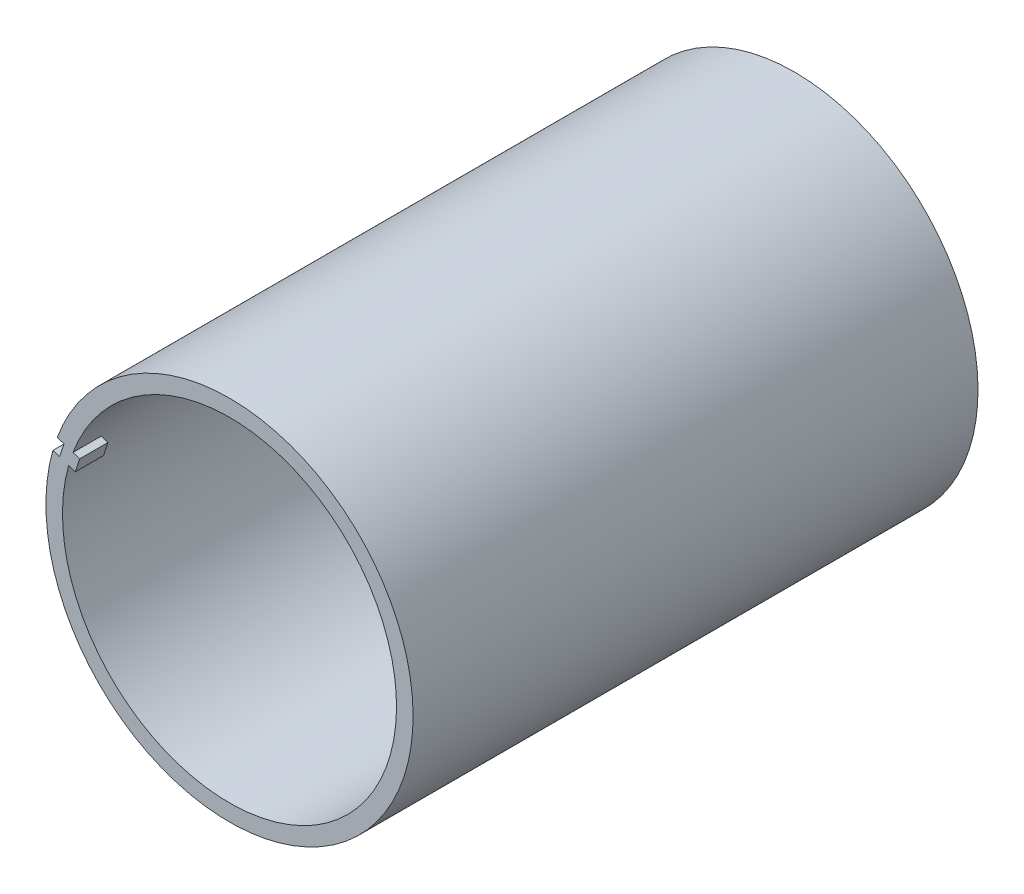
ISO-10303-21;
HEADER;
FILE_DESCRIPTION(('STEP AP214'),'2;1');
FILE_NAME('part.step','',(''),(''),'','','');
FILE_SCHEMA(('AUTOMOTIVE_DESIGN { 1 0 10303 214 1 1 1 1 }'));
ENDSEC;
DATA;
#1=APPLICATION_CONTEXT('core data for automotive mechanical design processes');
#2=APPLICATION_PROTOCOL_DEFINITION('international standard','automotive_design',2000,#1);
#3=PRODUCT_CONTEXT('',#1,'mechanical');
#4=PRODUCT('Part','Part','',(#3));
#5=PRODUCT_RELATED_PRODUCT_CATEGORY('part','',(#4));
#6=PRODUCT_DEFINITION_FORMATION('','',#4);
#7=PRODUCT_DEFINITION_CONTEXT('part definition',#1,'design');
#8=PRODUCT_DEFINITION('design','',#6,#7);
#9=PRODUCT_DEFINITION_SHAPE('','',#8);
#10=(LENGTH_UNIT() NAMED_UNIT(*) SI_UNIT(.MILLI.,.METRE.));
#11=(NAMED_UNIT(*) PLANE_ANGLE_UNIT() SI_UNIT($,.RADIAN.));
#12=(NAMED_UNIT(*) SI_UNIT($,.STERADIAN.) SOLID_ANGLE_UNIT());
#13=UNCERTAINTY_MEASURE_WITH_UNIT(LENGTH_MEASURE(1.E-05),#10,'distance_accuracy_value','');
#14=(GEOMETRIC_REPRESENTATION_CONTEXT(3) GLOBAL_UNCERTAINTY_ASSIGNED_CONTEXT((#13)) GLOBAL_UNIT_ASSIGNED_CONTEXT((#10,
#11,#12)) REPRESENTATION_CONTEXT('',''));
#15=CARTESIAN_POINT('',(0.,0.,0.));
#16=DIRECTION('',(0.,0.,1.));
#17=DIRECTION('',(1.,0.,0.));
#18=AXIS2_PLACEMENT_3D('',#15,#16,#17);
#19=CARTESIAN_POINT('',(0.,24.7771123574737,4.));
#20=DIRECTION('',(0.,0.,1.));
#21=DIRECTION('',(1.,0.,0.));
#22=AXIS2_PLACEMENT_3D('',#19,#20,#21);
#23=PLANE('',#22);
#24=DIRECTION('',(0.951056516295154,-0.309016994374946,0.));
#25=VECTOR('',#24,1.);
#26=CARTESIAN_POINT('',(-21.2122972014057,32.7208677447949,4.));
#27=LINE('',#26,#25);
#28=CARTESIAN_POINT('',(-22.1633537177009,33.0298847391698,4.));
#29=VERTEX_POINT('',#28);
#30=CARTESIAN_POINT('',(-21.2122972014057,32.7208677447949,4.));
#31=VERTEX_POINT('',#30);
#32=EDGE_CURVE('E249',#29,#31,#27,.T.);
#33=ORIENTED_EDGE('',*,*,#32,.F.);
#34=CARTESIAN_POINT('',(0.,24.7771123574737,4.));
#35=DIRECTION('',(0.,0.,1.));
#36=DIRECTION('',(1.,0.,0.));
#37=AXIS2_PLACEMENT_3D('',#34,#35,#36);
#38=CIRCLE('',#37,23.6500000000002);
#39=CARTESIAN_POINT('',(-22.7813877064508,31.1277717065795,4.));
#40=VERTEX_POINT('',#39);
#41=EDGE_CURVE('E218',#29,#40,#38,.T.);
#42=ORIENTED_EDGE('',*,*,#41,.T.);
#43=DIRECTION('',(-0.951056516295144,0.309016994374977,0.));
#44=VECTOR('',#43,1.);
#45=CARTESIAN_POINT('',(-21.8303311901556,30.8187547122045,4.));
#46=LINE('',#45,#44);
#47=CARTESIAN_POINT('',(-21.8303311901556,30.8187547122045,4.));
#48=VERTEX_POINT('',#47);
#49=EDGE_CURVE('E255',#48,#40,#46,.T.);
#50=ORIENTED_EDGE('',*,*,#49,.F.);
#51=DIRECTION('',(-0.309016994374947,-0.951056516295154,0.));
#52=VECTOR('',#51,1.);
#53=CARTESIAN_POINT('',(-21.2122972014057,32.7208677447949,4.));
#54=LINE('',#53,#52);
#55=EDGE_CURVE('E251',#31,#48,#54,.T.);
#56=ORIENTED_EDGE('',*,*,#55,.F.);
#57=EDGE_LOOP('',(#33,#42,#50,#56));
#58=FACE_BOUND('',#57,.T.);
#59=ADVANCED_FACE('F29',(#58),#23,.T.);
#60=CARTESIAN_POINT('',(0.,24.7771123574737,0.));
#61=DIRECTION('',(0.,0.,1.));
#62=DIRECTION('',(1.,0.,0.));
#63=AXIS2_PLACEMENT_3D('',#60,#61,#62);
#64=PLANE('',#63);
#65=CARTESIAN_POINT('',(0.,24.7771123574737,0.));
#66=DIRECTION('',(0.,0.,1.));
#67=DIRECTION('',(1.,0.,0.));
#68=AXIS2_PLACEMENT_3D('',#65,#66,#67);
#69=CIRCLE('',#68,25.9980881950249);
#70=CARTESIAN_POINT('',(-25.0163705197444,31.8539616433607,0.));
#71=VERTEX_POINT('',#70);
#72=CARTESIAN_POINT('',(-24.3983365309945,33.7560746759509,0.));
#73=VERTEX_POINT('',#72);
#74=EDGE_CURVE('E245',#71,#73,#69,.T.);
#75=ORIENTED_EDGE('',*,*,#74,.F.);
#76=DIRECTION('',(-0.951056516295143,0.30901699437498,0.));
#77=VECTOR('',#76,1.);
#78=CARTESIAN_POINT('',(-24.0653140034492,31.5449446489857,0.));
#79=LINE('',#78,#77);
#80=CARTESIAN_POINT('',(-24.0653140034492,31.5449446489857,0.));
#81=VERTEX_POINT('',#80);
#82=EDGE_CURVE('E300',#81,#71,#79,.T.);
#83=ORIENTED_EDGE('',*,*,#82,.F.);
#84=DIRECTION('',(-0.309016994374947,-0.951056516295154,0.));
#85=VECTOR('',#84,1.);
#86=CARTESIAN_POINT('',(-23.4472800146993,33.447057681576,0.));
#87=LINE('',#86,#85);
#88=CARTESIAN_POINT('',(-23.4472800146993,33.447057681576,0.));
#89=VERTEX_POINT('',#88);
#90=EDGE_CURVE('E291',#89,#81,#87,.T.);
#91=ORIENTED_EDGE('',*,*,#90,.F.);
#92=DIRECTION('',(0.951056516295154,-0.309016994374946,0.));
#93=VECTOR('',#92,1.);
#94=CARTESIAN_POINT('',(-23.4472800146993,33.447057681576,0.));
#95=LINE('',#94,#93);
#96=EDGE_CURVE('E299',#73,#89,#95,.T.);
#97=ORIENTED_EDGE('',*,*,#96,.F.);
#98=EDGE_LOOP('',(#75,#83,#91,#97));
#99=FACE_BOUND('',#98,.T.);
#100=CARTESIAN_POINT('',(0.,24.7771123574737,0.));
#101=DIRECTION('',(0.,0.,1.));
#102=DIRECTION('',(1.,0.,0.));
#103=AXIS2_PLACEMENT_3D('',#100,#101,#102);
#104=CIRCLE('',#103,23.6500000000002);
#105=CARTESIAN_POINT('',(-22.7813877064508,31.1277717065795,0.));
#106=VERTEX_POINT('',#105);
#107=CARTESIAN_POINT('',(-22.1633537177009,33.0298847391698,0.));
#108=VERTEX_POINT('',#107);
#109=EDGE_CURVE('E236',#106,#108,#104,.T.);
#110=ORIENTED_EDGE('',*,*,#109,.T.);
#111=DIRECTION('',(0.951056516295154,-0.309016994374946,0.));
#112=VECTOR('',#111,1.);
#113=CARTESIAN_POINT('',(-21.2122972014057,32.7208677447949,0.));
#114=LINE('',#113,#112);
#115=CARTESIAN_POINT('',(-21.2122972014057,32.7208677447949,0.));
#116=VERTEX_POINT('',#115);
#117=EDGE_CURVE('E314',#108,#116,#114,.T.);
#118=ORIENTED_EDGE('',*,*,#117,.T.);
#119=DIRECTION('',(-0.309016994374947,-0.951056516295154,0.));
#120=VECTOR('',#119,1.);
#121=CARTESIAN_POINT('',(-21.2122972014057,32.7208677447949,0.));
#122=LINE('',#121,#120);
#123=CARTESIAN_POINT('',(-21.8303311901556,30.8187547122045,0.));
#124=VERTEX_POINT('',#123);
#125=EDGE_CURVE('E312',#116,#124,#122,.T.);
#126=ORIENTED_EDGE('',*,*,#125,.T.);
#127=DIRECTION('',(-0.951056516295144,0.309016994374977,0.));
#128=VECTOR('',#127,1.);
#129=CARTESIAN_POINT('',(-21.8303311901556,30.8187547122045,0.));
#130=LINE('',#129,#128);
#131=EDGE_CURVE('E252',#124,#106,#130,.T.);
#132=ORIENTED_EDGE('',*,*,#131,.T.);
#133=EDGE_LOOP('',(#110,#118,#126,#132));
#134=FACE_BOUND('',#133,.T.);
#135=ADVANCED_FACE('F297',(#99,#134),#64,.F.);
#136=CARTESIAN_POINT('',(0.,24.7771123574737,4.));
#137=DIRECTION('',(0.,0.,-1.));
#138=DIRECTION('',(-1.,0.,0.));
#139=AXIS2_PLACEMENT_3D('',#136,#137,#138);
#140=CYLINDRICAL_SURFACE('',#139,25.9980881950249);
#141=ORIENTED_EDGE('',*,*,#74,.T.);
#142=DIRECTION('',(0.,0.,-1.));
#143=VECTOR('',#142,1.);
#144=CARTESIAN_POINT('',(-24.3983365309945,33.7560746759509,4.));
#145=LINE('',#144,#143);
#146=CARTESIAN_POINT('',(-24.3983365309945,33.7560746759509,4.));
#147=VERTEX_POINT('',#146);
#148=EDGE_CURVE('E11',#147,#73,#145,.T.);
#149=ORIENTED_EDGE('',*,*,#148,.F.);
#150=CARTESIAN_POINT('',(0.,24.7771123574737,4.));
#151=DIRECTION('',(0.,0.,1.));
#152=DIRECTION('',(1.,0.,0.));
#153=AXIS2_PLACEMENT_3D('',#150,#151,#152);
#154=CIRCLE('',#153,25.9980881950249);
#155=CARTESIAN_POINT('',(-25.0163705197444,31.8539616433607,4.));
#156=VERTEX_POINT('',#155);
#157=EDGE_CURVE('E229',#147,#156,#154,.T.);
#158=ORIENTED_EDGE('',*,*,#157,.T.);
#159=DIRECTION('',(0.,0.,-1.));
#160=VECTOR('',#159,1.);
#161=CARTESIAN_POINT('',(-25.0163705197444,31.8539616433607,4.));
#162=LINE('',#161,#160);
#163=EDGE_CURVE('E266',#156,#71,#162,.T.);
#164=ORIENTED_EDGE('',*,*,#163,.T.);
#165=EDGE_LOOP('',(#141,#149,#158,#164));
#166=FACE_BOUND('',#165,.T.);
#167=CARTESIAN_POINT('',(0.,24.7771123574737,76.));
#168=DIRECTION('',(0.,0.,1.));
#169=DIRECTION('',(1.,0.,0.));
#170=AXIS2_PLACEMENT_3D('',#167,#168,#169);
#171=CIRCLE('',#170,25.9980881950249);
#172=CARTESIAN_POINT('',(-24.3983365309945,33.7560746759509,76.));
#173=VERTEX_POINT('',#172);
#174=CARTESIAN_POINT('',(-25.0163705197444,31.8539616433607,76.));
#175=VERTEX_POINT('',#174);
#176=EDGE_CURVE('E232',#173,#175,#171,.T.);
#177=ORIENTED_EDGE('',*,*,#176,.F.);
#178=DIRECTION('',(0.,0.,-1.));
#179=VECTOR('',#178,1.);
#180=CARTESIAN_POINT('',(-24.3983365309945,33.7560746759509,80.));
#181=LINE('',#180,#179);
#182=CARTESIAN_POINT('',(-24.3983365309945,33.7560746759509,80.));
#183=VERTEX_POINT('',#182);
#184=EDGE_CURVE('E217',#183,#173,#181,.T.);
#185=ORIENTED_EDGE('',*,*,#184,.F.);
#186=CARTESIAN_POINT('',(0.,24.7771123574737,80.));
#187=DIRECTION('',(0.,0.,1.));
#188=DIRECTION('',(1.,0.,0.));
#189=AXIS2_PLACEMENT_3D('',#186,#187,#188);
#190=CIRCLE('',#189,25.9980881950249);
#191=CARTESIAN_POINT('',(-25.0163705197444,31.8539616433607,80.));
#192=VERTEX_POINT('',#191);
#193=EDGE_CURVE('E193',#192,#183,#190,.T.);
#194=ORIENTED_EDGE('',*,*,#193,.F.);
#195=DIRECTION('',(0.,0.,-1.));
#196=VECTOR('',#195,1.);
#197=CARTESIAN_POINT('',(-25.0163705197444,31.8539616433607,80.));
#198=LINE('',#197,#196);
#199=EDGE_CURVE('E200',#192,#175,#198,.T.);
#200=ORIENTED_EDGE('',*,*,#199,.T.);
#201=EDGE_LOOP('',(#177,#185,#194,#200));
#202=FACE_BOUND('',#201,.T.);
#203=ADVANCED_FACE('F31',(#166,#202),#140,.T.);
#204=CARTESIAN_POINT('',(-23.4472800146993,33.447057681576,4.));
#205=DIRECTION('',(0.309016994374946,0.951056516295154,0.));
#206=DIRECTION('',(-0.951056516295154,0.309016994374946,0.));
#207=AXIS2_PLACEMENT_3D('',#204,#205,#206);
#208=PLANE('',#207);
#209=ORIENTED_EDGE('',*,*,#96,.T.);
#210=DIRECTION('',(0.,0.,-1.));
#211=VECTOR('',#210,1.);
#212=CARTESIAN_POINT('',(-23.4472800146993,33.447057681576,4.));
#213=LINE('',#212,#211);
#214=CARTESIAN_POINT('',(-23.4472800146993,33.447057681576,4.));
#215=VERTEX_POINT('',#214);
#216=EDGE_CURVE('E38',#215,#89,#213,.T.);
#217=ORIENTED_EDGE('',*,*,#216,.F.);
#218=DIRECTION('',(0.951056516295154,-0.309016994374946,0.));
#219=VECTOR('',#218,1.);
#220=CARTESIAN_POINT('',(-23.4472800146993,33.447057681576,4.));
#221=LINE('',#220,#219);
#222=EDGE_CURVE('E277',#147,#215,#221,.T.);
#223=ORIENTED_EDGE('',*,*,#222,.F.);
#224=ORIENTED_EDGE('',*,*,#148,.T.);
#225=EDGE_LOOP('',(#209,#217,#223,#224));
#226=FACE_BOUND('',#225,.T.);
#227=ADVANCED_FACE('F349',(#226),#208,.F.);
#228=CARTESIAN_POINT('',(-23.4472800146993,33.447057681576,4.));
#229=DIRECTION('',(0.951056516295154,-0.309016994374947,0.));
#230=DIRECTION('',(0.309016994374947,0.951056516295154,0.));
#231=AXIS2_PLACEMENT_3D('',#228,#229,#230);
#232=PLANE('',#231);
#233=ORIENTED_EDGE('',*,*,#90,.T.);
#234=DIRECTION('',(0.,0.,-1.));
#235=VECTOR('',#234,1.);
#236=CARTESIAN_POINT('',(-24.0653140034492,31.5449446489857,4.));
#237=LINE('',#236,#235);
#238=CARTESIAN_POINT('',(-24.0653140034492,31.5449446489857,4.));
#239=VERTEX_POINT('',#238);
#240=EDGE_CURVE('E269',#239,#81,#237,.T.);
#241=ORIENTED_EDGE('',*,*,#240,.F.);
#242=DIRECTION('',(-0.309016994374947,-0.951056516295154,0.));
#243=VECTOR('',#242,1.);
#244=CARTESIAN_POINT('',(-23.4472800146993,33.447057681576,4.));
#245=LINE('',#244,#243);
#246=EDGE_CURVE('E276',#215,#239,#245,.T.);
#247=ORIENTED_EDGE('',*,*,#246,.F.);
#248=ORIENTED_EDGE('',*,*,#216,.T.);
#249=EDGE_LOOP('',(#233,#241,#247,#248));
#250=FACE_BOUND('',#249,.T.);
#251=ADVANCED_FACE('F290',(#250),#232,.F.);
#252=CARTESIAN_POINT('',(-24.0653140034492,31.5449446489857,4.));
#253=DIRECTION('',(-0.30901699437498,-0.951056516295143,0.));
#254=DIRECTION('',(0.951056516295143,-0.30901699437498,0.));
#255=AXIS2_PLACEMENT_3D('',#252,#253,#254);
#256=PLANE('',#255);
#257=ORIENTED_EDGE('',*,*,#82,.T.);
#258=ORIENTED_EDGE('',*,*,#163,.F.);
#259=DIRECTION('',(-0.951056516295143,0.30901699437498,0.));
#260=VECTOR('',#259,1.);
#261=CARTESIAN_POINT('',(-24.0653140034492,31.5449446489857,4.));
#262=LINE('',#261,#260);
#263=EDGE_CURVE('E270',#239,#156,#262,.T.);
#264=ORIENTED_EDGE('',*,*,#263,.F.);
#265=ORIENTED_EDGE('',*,*,#240,.T.);
#266=EDGE_LOOP('',(#257,#258,#264,#265));
#267=FACE_BOUND('',#266,.T.);
#268=ADVANCED_FACE('F345',(#267),#256,.F.);
#269=CARTESIAN_POINT('',(0.,24.7771123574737,4.));
#270=DIRECTION('',(0.,0.,-1.));
#271=DIRECTION('',(-1.,0.,0.));
#272=AXIS2_PLACEMENT_3D('',#269,#270,#271);
#273=CYLINDRICAL_SURFACE('',#272,23.6500000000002);
#274=ORIENTED_EDGE('',*,*,#109,.F.);
#275=DIRECTION('',(0.,0.,-1.));
#276=VECTOR('',#275,1.);
#277=CARTESIAN_POINT('',(-22.7813877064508,31.1277717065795,4.));
#278=LINE('',#277,#276);
#279=EDGE_CURVE('E258',#40,#106,#278,.T.);
#280=ORIENTED_EDGE('',*,*,#279,.F.);
#281=ORIENTED_EDGE('',*,*,#41,.F.);
#282=DIRECTION('',(0.,0.,-1.));
#283=VECTOR('',#282,1.);
#284=CARTESIAN_POINT('',(-22.1633537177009,33.0298847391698,4.));
#285=LINE('',#284,#283);
#286=EDGE_CURVE('E242',#29,#108,#285,.T.);
#287=ORIENTED_EDGE('',*,*,#286,.T.);
#288=EDGE_LOOP('',(#274,#280,#281,#287));
#289=FACE_BOUND('',#288,.T.);
#290=CARTESIAN_POINT('',(0.,24.7771123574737,76.));
#291=DIRECTION('',(0.,0.,1.));
#292=DIRECTION('',(1.,0.,0.));
#293=AXIS2_PLACEMENT_3D('',#290,#291,#292);
#294=CIRCLE('',#293,23.6500000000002);
#295=CARTESIAN_POINT('',(-22.1633537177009,33.0298847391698,76.));
#296=VERTEX_POINT('',#295);
#297=CARTESIAN_POINT('',(-22.7813877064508,31.1277717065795,76.));
#298=VERTEX_POINT('',#297);
#299=EDGE_CURVE('E166',#296,#298,#294,.T.);
#300=ORIENTED_EDGE('',*,*,#299,.T.);
#301=DIRECTION('',(0.,0.,-1.));
#302=VECTOR('',#301,1.);
#303=CARTESIAN_POINT('',(-22.7813877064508,31.1277717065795,80.));
#304=LINE('',#303,#302);
#305=CARTESIAN_POINT('',(-22.7813877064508,31.1277717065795,80.));
#306=VERTEX_POINT('',#305);
#307=EDGE_CURVE('E174',#306,#298,#304,.T.);
#308=ORIENTED_EDGE('',*,*,#307,.F.);
#309=CARTESIAN_POINT('',(0.,24.7771123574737,80.));
#310=DIRECTION('',(0.,0.,1.));
#311=DIRECTION('',(1.,0.,0.));
#312=AXIS2_PLACEMENT_3D('',#309,#310,#311);
#313=CIRCLE('',#312,23.6500000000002);
#314=CARTESIAN_POINT('',(-22.1633537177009,33.0298847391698,80.));
#315=VERTEX_POINT('',#314);
#316=EDGE_CURVE('E178',#306,#315,#313,.T.);
#317=ORIENTED_EDGE('',*,*,#316,.T.);
#318=DIRECTION('',(0.,0.,-1.));
#319=VECTOR('',#318,1.);
#320=CARTESIAN_POINT('',(-22.1633537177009,33.0298847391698,80.));
#321=LINE('',#320,#319);
#322=EDGE_CURVE('E54',#315,#296,#321,.T.);
#323=ORIENTED_EDGE('',*,*,#322,.T.);
#324=EDGE_LOOP('',(#300,#308,#317,#323));
#325=FACE_BOUND('',#324,.T.);
#326=ADVANCED_FACE('F323',(#289,#325),#273,.F.);
#327=CARTESIAN_POINT('',(-21.2122972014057,32.7208677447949,4.));
#328=DIRECTION('',(0.309016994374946,0.951056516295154,0.));
#329=DIRECTION('',(-0.951056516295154,0.309016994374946,0.));
#330=AXIS2_PLACEMENT_3D('',#327,#328,#329);
#331=PLANE('',#330);
#332=ORIENTED_EDGE('',*,*,#117,.F.);
#333=ORIENTED_EDGE('',*,*,#286,.F.);
#334=ORIENTED_EDGE('',*,*,#32,.T.);
#335=DIRECTION('',(0.,0.,-1.));
#336=VECTOR('',#335,1.);
#337=CARTESIAN_POINT('',(-21.2122972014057,32.7208677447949,4.));
#338=LINE('',#337,#336);
#339=EDGE_CURVE('E246',#31,#116,#338,.T.);
#340=ORIENTED_EDGE('',*,*,#339,.T.);
#341=EDGE_LOOP('',(#332,#333,#334,#340));
#342=FACE_BOUND('',#341,.T.);
#343=ADVANCED_FACE('F378',(#342),#331,.T.);
#344=CARTESIAN_POINT('',(-21.2122972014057,32.7208677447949,4.));
#345=DIRECTION('',(0.951056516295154,-0.309016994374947,0.));
#346=DIRECTION('',(0.309016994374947,0.951056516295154,0.));
#347=AXIS2_PLACEMENT_3D('',#344,#345,#346);
#348=PLANE('',#347);
#349=ORIENTED_EDGE('',*,*,#125,.F.);
#350=ORIENTED_EDGE('',*,*,#339,.F.);
#351=ORIENTED_EDGE('',*,*,#55,.T.);
#352=DIRECTION('',(0.,0.,-1.));
#353=VECTOR('',#352,1.);
#354=CARTESIAN_POINT('',(-21.8303311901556,30.8187547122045,4.));
#355=LINE('',#354,#353);
#356=EDGE_CURVE('E263',#48,#124,#355,.T.);
#357=ORIENTED_EDGE('',*,*,#356,.T.);
#358=EDGE_LOOP('',(#349,#350,#351,#357));
#359=FACE_BOUND('',#358,.T.);
#360=ADVANCED_FACE('F369',(#359),#348,.T.);
#361=CARTESIAN_POINT('',(-21.8303311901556,30.8187547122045,4.));
#362=DIRECTION('',(-0.309016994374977,-0.951056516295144,0.));
#363=DIRECTION('',(0.951056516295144,-0.309016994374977,0.));
#364=AXIS2_PLACEMENT_3D('',#361,#362,#363);
#365=PLANE('',#364);
#366=ORIENTED_EDGE('',*,*,#131,.F.);
#367=ORIENTED_EDGE('',*,*,#356,.F.);
#368=ORIENTED_EDGE('',*,*,#49,.T.);
#369=ORIENTED_EDGE('',*,*,#279,.T.);
#370=EDGE_LOOP('',(#366,#367,#368,#369));
#371=FACE_BOUND('',#370,.T.);
#372=ADVANCED_FACE('F362',(#371),#365,.T.);
#373=CARTESIAN_POINT('',(0.,24.7771123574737,4.));
#374=DIRECTION('',(0.,0.,1.));
#375=DIRECTION('',(1.,0.,0.));
#376=AXIS2_PLACEMENT_3D('',#373,#374,#375);
#377=PLANE('',#376);
#378=ORIENTED_EDGE('',*,*,#157,.F.);
#379=ORIENTED_EDGE('',*,*,#222,.T.);
#380=ORIENTED_EDGE('',*,*,#246,.T.);
#381=ORIENTED_EDGE('',*,*,#263,.T.);
#382=EDGE_LOOP('',(#378,#379,#380,#381));
#383=FACE_BOUND('',#382,.T.);
#384=ADVANCED_FACE('F359',(#383),#377,.F.);
#385=CARTESIAN_POINT('',(0.,24.7771123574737,76.));
#386=DIRECTION('',(0.,0.,1.));
#387=DIRECTION('',(1.,0.,0.));
#388=AXIS2_PLACEMENT_3D('',#385,#386,#387);
#389=PLANE('',#388);
#390=DIRECTION('',(-0.951056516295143,0.30901699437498,0.));
#391=VECTOR('',#390,1.);
#392=CARTESIAN_POINT('',(-24.0653140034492,31.5449446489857,76.));
#393=LINE('',#392,#391);
#394=CARTESIAN_POINT('',(-24.0653140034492,31.5449446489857,76.));
#395=VERTEX_POINT('',#394);
#396=EDGE_CURVE('E46',#395,#175,#393,.T.);
#397=ORIENTED_EDGE('',*,*,#396,.F.);
#398=DIRECTION('',(-0.309016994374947,-0.951056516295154,0.));
#399=VECTOR('',#398,1.);
#400=CARTESIAN_POINT('',(-23.4472800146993,33.447057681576,76.));
#401=LINE('',#400,#399);
#402=CARTESIAN_POINT('',(-23.4472800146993,33.447057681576,76.));
#403=VERTEX_POINT('',#402);
#404=EDGE_CURVE('E188',#403,#395,#401,.T.);
#405=ORIENTED_EDGE('',*,*,#404,.F.);
#406=DIRECTION('',(0.951056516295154,-0.309016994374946,0.));
#407=VECTOR('',#406,1.);
#408=CARTESIAN_POINT('',(-24.3983365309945,33.7560746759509,76.));
#409=LINE('',#408,#407);
#410=EDGE_CURVE('E190',#173,#403,#409,.T.);
#411=ORIENTED_EDGE('',*,*,#410,.F.);
#412=ORIENTED_EDGE('',*,*,#176,.T.);
#413=EDGE_LOOP('',(#397,#405,#411,#412));
#414=FACE_BOUND('',#413,.T.);
#415=ADVANCED_FACE('F361',(#414),#389,.T.);
#416=CARTESIAN_POINT('',(0.,24.7771123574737,80.));
#417=DIRECTION('',(0.,0.,1.));
#418=DIRECTION('',(1.,0.,0.));
#419=AXIS2_PLACEMENT_3D('',#416,#417,#418);
#420=PLANE('',#419);
#421=ORIENTED_EDGE('',*,*,#193,.T.);
#422=DIRECTION('',(0.951056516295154,-0.309016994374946,0.));
#423=VECTOR('',#422,1.);
#424=CARTESIAN_POINT('',(-24.3983365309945,33.7560746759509,80.));
#425=LINE('',#424,#423);
#426=CARTESIAN_POINT('',(-23.4472800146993,33.447057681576,80.));
#427=VERTEX_POINT('',#426);
#428=EDGE_CURVE('E489',#183,#427,#425,.T.);
#429=ORIENTED_EDGE('',*,*,#428,.T.);
#430=DIRECTION('',(-0.309016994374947,-0.951056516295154,0.));
#431=VECTOR('',#430,1.);
#432=CARTESIAN_POINT('',(-23.4472800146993,33.447057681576,80.));
#433=LINE('',#432,#431);
#434=CARTESIAN_POINT('',(-24.0653140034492,31.5449446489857,80.));
#435=VERTEX_POINT('',#434);
#436=EDGE_CURVE('E490',#427,#435,#433,.T.);
#437=ORIENTED_EDGE('',*,*,#436,.T.);
#438=DIRECTION('',(-0.951056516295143,0.30901699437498,0.));
#439=VECTOR('',#438,1.);
#440=CARTESIAN_POINT('',(-24.0653140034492,31.5449446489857,80.));
#441=LINE('',#440,#439);
#442=EDGE_CURVE('E204',#435,#192,#441,.T.);
#443=ORIENTED_EDGE('',*,*,#442,.T.);
#444=EDGE_LOOP('',(#421,#429,#437,#443));
#445=FACE_BOUND('',#444,.T.);
#446=DIRECTION('',(0.951056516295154,-0.309016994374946,0.));
#447=VECTOR('',#446,1.);
#448=CARTESIAN_POINT('',(-21.2122972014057,32.7208677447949,80.));
#449=LINE('',#448,#447);
#450=CARTESIAN_POINT('',(-21.2122972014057,32.7208677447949,80.));
#451=VERTEX_POINT('',#450);
#452=EDGE_CURVE('E151',#315,#451,#449,.T.);
#453=ORIENTED_EDGE('',*,*,#452,.F.);
#454=ORIENTED_EDGE('',*,*,#316,.F.);
#455=DIRECTION('',(-0.951056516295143,0.309016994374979,0.));
#456=VECTOR('',#455,1.);
#457=CARTESIAN_POINT('',(-21.8303311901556,30.8187547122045,80.));
#458=LINE('',#457,#456);
#459=CARTESIAN_POINT('',(-21.8303311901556,30.8187547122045,80.));
#460=VERTEX_POINT('',#459);
#461=EDGE_CURVE('E176',#460,#306,#458,.T.);
#462=ORIENTED_EDGE('',*,*,#461,.F.);
#463=DIRECTION('',(-0.309016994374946,-0.951056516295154,0.));
#464=VECTOR('',#463,1.);
#465=CARTESIAN_POINT('',(-21.2122972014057,32.7208677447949,80.));
#466=LINE('',#465,#464);
#467=EDGE_CURVE('E182',#451,#460,#466,.T.);
#468=ORIENTED_EDGE('',*,*,#467,.F.);
#469=EDGE_LOOP('',(#453,#454,#462,#468));
#470=FACE_BOUND('',#469,.T.);
#471=ADVANCED_FACE('F327',(#445,#470),#420,.T.);
#472=CARTESIAN_POINT('',(0.,24.7771123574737,76.));
#473=DIRECTION('',(0.,0.,1.));
#474=DIRECTION('',(1.,0.,0.));
#475=AXIS2_PLACEMENT_3D('',#472,#473,#474);
#476=PLANE('',#475);
#477=ORIENTED_EDGE('',*,*,#299,.F.);
#478=DIRECTION('',(0.951056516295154,-0.309016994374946,0.));
#479=VECTOR('',#478,1.);
#480=CARTESIAN_POINT('',(-21.2122972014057,32.7208677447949,76.));
#481=LINE('',#480,#479);
#482=CARTESIAN_POINT('',(-21.2122972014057,32.7208677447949,76.));
#483=VERTEX_POINT('',#482);
#484=EDGE_CURVE('E148',#296,#483,#481,.T.);
#485=ORIENTED_EDGE('',*,*,#484,.T.);
#486=DIRECTION('',(-0.309016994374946,-0.951056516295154,0.));
#487=VECTOR('',#486,1.);
#488=CARTESIAN_POINT('',(-21.2122972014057,32.7208677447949,76.));
#489=LINE('',#488,#487);
#490=CARTESIAN_POINT('',(-21.8303311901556,30.8187547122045,76.));
#491=VERTEX_POINT('',#490);
#492=EDGE_CURVE('E158',#483,#491,#489,.T.);
#493=ORIENTED_EDGE('',*,*,#492,.T.);
#494=DIRECTION('',(-0.951056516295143,0.309016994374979,0.));
#495=VECTOR('',#494,1.);
#496=CARTESIAN_POINT('',(-21.8303311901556,30.8187547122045,76.));
#497=LINE('',#496,#495);
#498=EDGE_CURVE('E163',#491,#298,#497,.T.);
#499=ORIENTED_EDGE('',*,*,#498,.T.);
#500=EDGE_LOOP('',(#477,#485,#493,#499));
#501=FACE_BOUND('',#500,.T.);
#502=ADVANCED_FACE('F165',(#501),#476,.F.);
#503=CARTESIAN_POINT('',(-24.3983365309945,33.7560746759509,80.));
#504=DIRECTION('',(0.309016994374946,0.951056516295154,0.));
#505=DIRECTION('',(-0.951056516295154,0.309016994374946,0.));
#506=AXIS2_PLACEMENT_3D('',#503,#504,#505);
#507=PLANE('',#506);
#508=ORIENTED_EDGE('',*,*,#410,.T.);
#509=DIRECTION('',(0.,0.,-1.));
#510=VECTOR('',#509,1.);
#511=CARTESIAN_POINT('',(-23.4472800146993,33.447057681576,80.));
#512=LINE('',#511,#510);
#513=EDGE_CURVE('E219',#427,#403,#512,.T.);
#514=ORIENTED_EDGE('',*,*,#513,.F.);
#515=ORIENTED_EDGE('',*,*,#428,.F.);
#516=ORIENTED_EDGE('',*,*,#184,.T.);
#517=EDGE_LOOP('',(#508,#514,#515,#516));
#518=FACE_BOUND('',#517,.T.);
#519=ADVANCED_FACE('F373',(#518),#507,.F.);
#520=CARTESIAN_POINT('',(-23.4472800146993,33.447057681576,80.));
#521=DIRECTION('',(0.951056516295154,-0.309016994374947,0.));
#522=DIRECTION('',(0.309016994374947,0.951056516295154,0.));
#523=AXIS2_PLACEMENT_3D('',#520,#521,#522);
#524=PLANE('',#523);
#525=ORIENTED_EDGE('',*,*,#404,.T.);
#526=DIRECTION('',(0.,0.,-1.));
#527=VECTOR('',#526,1.);
#528=CARTESIAN_POINT('',(-24.0653140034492,31.5449446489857,80.));
#529=LINE('',#528,#527);
#530=EDGE_CURVE('E203',#435,#395,#529,.T.);
#531=ORIENTED_EDGE('',*,*,#530,.F.);
#532=ORIENTED_EDGE('',*,*,#436,.F.);
#533=ORIENTED_EDGE('',*,*,#513,.T.);
#534=EDGE_LOOP('',(#525,#531,#532,#533));
#535=FACE_BOUND('',#534,.T.);
#536=ADVANCED_FACE('F446',(#535),#524,.F.);
#537=CARTESIAN_POINT('',(-24.0653140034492,31.5449446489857,80.));
#538=DIRECTION('',(-0.30901699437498,-0.951056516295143,0.));
#539=DIRECTION('',(0.951056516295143,-0.30901699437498,0.));
#540=AXIS2_PLACEMENT_3D('',#537,#538,#539);
#541=PLANE('',#540);
#542=ORIENTED_EDGE('',*,*,#396,.T.);
#543=ORIENTED_EDGE('',*,*,#199,.F.);
#544=ORIENTED_EDGE('',*,*,#442,.F.);
#545=ORIENTED_EDGE('',*,*,#530,.T.);
#546=EDGE_LOOP('',(#542,#543,#544,#545));
#547=FACE_BOUND('',#546,.T.);
#548=ADVANCED_FACE('F454',(#547),#541,.F.);
#549=CARTESIAN_POINT('',(-21.2122972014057,32.7208677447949,80.));
#550=DIRECTION('',(0.309016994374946,0.951056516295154,0.));
#551=DIRECTION('',(-0.951056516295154,0.309016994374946,0.));
#552=AXIS2_PLACEMENT_3D('',#549,#550,#551);
#553=PLANE('',#552);
#554=ORIENTED_EDGE('',*,*,#484,.F.);
#555=ORIENTED_EDGE('',*,*,#322,.F.);
#556=ORIENTED_EDGE('',*,*,#452,.T.);
#557=DIRECTION('',(0.,0.,-1.));
#558=VECTOR('',#557,1.);
#559=CARTESIAN_POINT('',(-21.2122972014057,32.7208677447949,80.));
#560=LINE('',#559,#558);
#561=EDGE_CURVE('E144',#451,#483,#560,.T.);
#562=ORIENTED_EDGE('',*,*,#561,.T.);
#563=EDGE_LOOP('',(#554,#555,#556,#562));
#564=FACE_BOUND('',#563,.T.);
#565=ADVANCED_FACE('F146',(#564),#553,.T.);
#566=CARTESIAN_POINT('',(-21.2122972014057,32.7208677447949,80.));
#567=DIRECTION('',(0.951056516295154,-0.309016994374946,0.));
#568=DIRECTION('',(0.309016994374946,0.951056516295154,0.));
#569=AXIS2_PLACEMENT_3D('',#566,#567,#568);
#570=PLANE('',#569);
#571=ORIENTED_EDGE('',*,*,#492,.F.);
#572=ORIENTED_EDGE('',*,*,#561,.F.);
#573=ORIENTED_EDGE('',*,*,#467,.T.);
#574=DIRECTION('',(0.,0.,-1.));
#575=VECTOR('',#574,1.);
#576=CARTESIAN_POINT('',(-21.8303311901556,30.8187547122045,80.));
#577=LINE('',#576,#575);
#578=EDGE_CURVE('E155',#460,#491,#577,.T.);
#579=ORIENTED_EDGE('',*,*,#578,.T.);
#580=EDGE_LOOP('',(#571,#572,#573,#579));
#581=FACE_BOUND('',#580,.T.);
#582=ADVANCED_FACE('F159',(#581),#570,.T.);
#583=CARTESIAN_POINT('',(-21.8303311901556,30.8187547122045,80.));
#584=DIRECTION('',(-0.309016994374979,-0.951056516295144,0.));
#585=DIRECTION('',(0.951056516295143,-0.309016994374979,0.));
#586=AXIS2_PLACEMENT_3D('',#583,#584,#585);
#587=PLANE('',#586);
#588=ORIENTED_EDGE('',*,*,#498,.F.);
#589=ORIENTED_EDGE('',*,*,#578,.F.);
#590=ORIENTED_EDGE('',*,*,#461,.T.);
#591=ORIENTED_EDGE('',*,*,#307,.T.);
#592=EDGE_LOOP('',(#588,#589,#590,#591));
#593=FACE_BOUND('',#592,.T.);
#594=ADVANCED_FACE('F328',(#593),#587,.T.);
#595=CLOSED_SHELL('',(#59,#135,#203,#227,#251,#268,#326,#343,#360,#372,#384,#415,#471,#502,#519,
#536,#548,#565,#582,#594));
#596=MANIFOLD_SOLID_BREP('B2',#595);
#597=ADVANCED_BREP_SHAPE_REPRESENTATION('',(#18,#596),#14);
#598=SHAPE_DEFINITION_REPRESENTATION(#9,#597);
ENDSEC;
END-ISO-10303-21;
